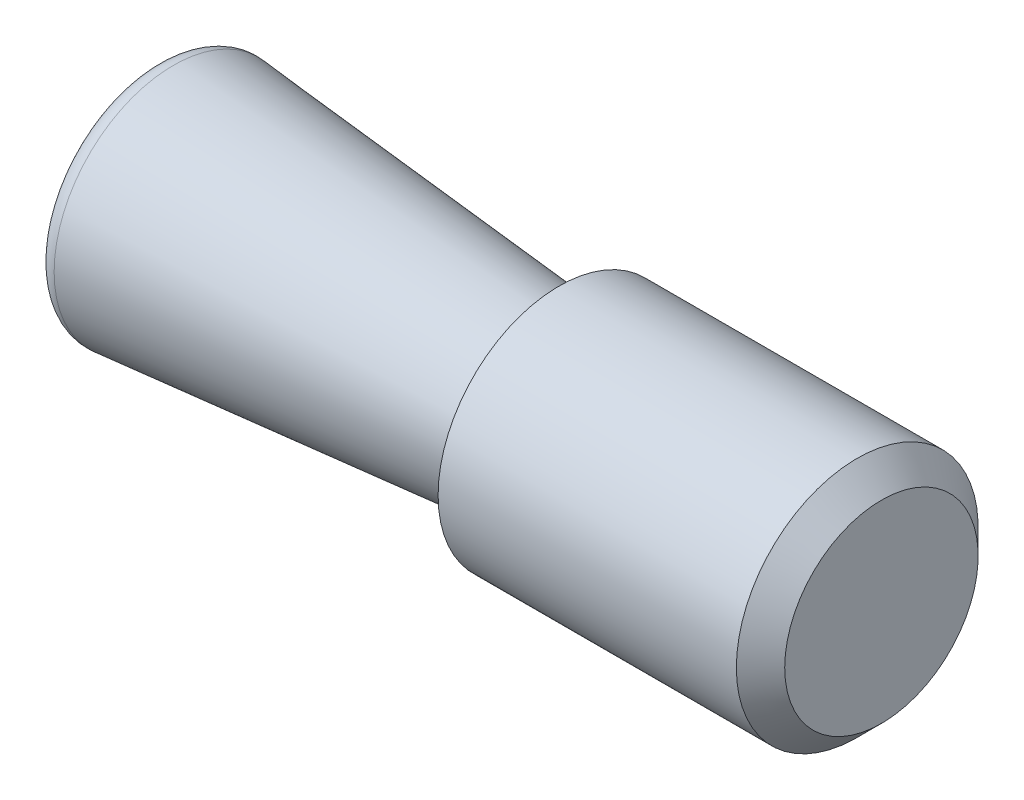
ISO-10303-21;
HEADER;
FILE_DESCRIPTION(('STEP AP214'),'2;1');
FILE_NAME('part.step','',(''),(''),'','','');
FILE_SCHEMA(('AUTOMOTIVE_DESIGN { 1 0 10303 214 1 1 1 1 }'));
ENDSEC;
DATA;
#1=APPLICATION_CONTEXT('core data for automotive mechanical design processes');
#2=APPLICATION_PROTOCOL_DEFINITION('international standard','automotive_design',2000,#1);
#3=PRODUCT_CONTEXT('',#1,'mechanical');
#4=PRODUCT('Part','Part','',(#3));
#5=PRODUCT_RELATED_PRODUCT_CATEGORY('part','',(#4));
#6=PRODUCT_DEFINITION_FORMATION('','',#4);
#7=PRODUCT_DEFINITION_CONTEXT('part definition',#1,'design');
#8=PRODUCT_DEFINITION('design','',#6,#7);
#9=PRODUCT_DEFINITION_SHAPE('','',#8);
#10=(LENGTH_UNIT() NAMED_UNIT(*) SI_UNIT(.MILLI.,.METRE.));
#11=(NAMED_UNIT(*) PLANE_ANGLE_UNIT() SI_UNIT($,.RADIAN.));
#12=(NAMED_UNIT(*) SI_UNIT($,.STERADIAN.) SOLID_ANGLE_UNIT());
#13=UNCERTAINTY_MEASURE_WITH_UNIT(LENGTH_MEASURE(1.E-05),#10,'distance_accuracy_value','');
#14=(GEOMETRIC_REPRESENTATION_CONTEXT(3) GLOBAL_UNCERTAINTY_ASSIGNED_CONTEXT((#13)) GLOBAL_UNIT_ASSIGNED_CONTEXT((#10,
#11,#12)) REPRESENTATION_CONTEXT('',''));
#15=CARTESIAN_POINT('',(0.,0.,0.));
#16=DIRECTION('',(0.,0.,1.));
#17=DIRECTION('',(1.,0.,0.));
#18=AXIS2_PLACEMENT_3D('',#15,#16,#17);
#19=CARTESIAN_POINT('',(0.,1.5,0.));
#20=DIRECTION('',(1.,0.,0.));
#21=DIRECTION('',(0.,0.,-1.));
#22=AXIS2_PLACEMENT_3D('',#19,#20,#21);
#23=PLANE('',#22);
#24=CARTESIAN_POINT('',(0.,0.,0.));
#25=DIRECTION('',(1.,0.,0.));
#26=DIRECTION('',(0.,0.,-1.));
#27=AXIS2_PLACEMENT_3D('',#24,#25,#26);
#28=CIRCLE('',#27,1.28173829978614);
#29=CARTESIAN_POINT('',(0.,0.,-1.28173829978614));
#30=VERTEX_POINT('',#29);
#31=EDGE_CURVE('E44',#30,#30,#28,.F.);
#32=ORIENTED_EDGE('',*,*,#31,.T.);
#33=EDGE_LOOP('',(#32));
#34=FACE_BOUND('',#33,.T.);
#35=ADVANCED_FACE('F30',(#34),#23,.F.);
#36=CARTESIAN_POINT('',(9.,0.,0.));
#37=DIRECTION('',(-1.,0.,0.));
#38=DIRECTION('',(0.,0.,1.));
#39=AXIS2_PLACEMENT_3D('',#36,#37,#38);
#40=PLANE('',#39);
#41=CARTESIAN_POINT('',(9.,0.,0.));
#42=DIRECTION('',(-1.,0.,0.));
#43=DIRECTION('',(0.,0.,1.));
#44=AXIS2_PLACEMENT_3D('',#41,#42,#43);
#45=CIRCLE('',#44,1.2);
#46=CARTESIAN_POINT('',(9.,0.,1.2));
#47=VERTEX_POINT('',#46);
#48=EDGE_CURVE('E10',#47,#47,#45,.F.);
#49=ORIENTED_EDGE('',*,*,#48,.T.);
#50=EDGE_LOOP('',(#49));
#51=FACE_BOUND('',#50,.T.);
#52=ADVANCED_FACE('F66',(#51),#40,.F.);
#53=CARTESIAN_POINT('',(0.,0.,0.));
#54=DIRECTION('',(-1.,0.,0.));
#55=DIRECTION('',(0.,0.,1.));
#56=AXIS2_PLACEMENT_3D('',#53,#54,#55);
#57=CYLINDRICAL_SURFACE('',#56,1.5);
#58=CARTESIAN_POINT('',(8.7,0.,0.));
#59=DIRECTION('',(-1.,0.,0.));
#60=DIRECTION('',(0.,0.,1.));
#61=AXIS2_PLACEMENT_3D('',#58,#59,#60);
#62=CIRCLE('',#61,1.5);
#63=CARTESIAN_POINT('',(8.7,0.,1.5));
#64=VERTEX_POINT('',#63);
#65=EDGE_CURVE('E36',#64,#64,#62,.T.);
#66=ORIENTED_EDGE('',*,*,#65,.T.);
#67=EDGE_LOOP('',(#66));
#68=FACE_BOUND('',#67,.T.);
#69=CARTESIAN_POINT('',(5.,0.,0.));
#70=DIRECTION('',(-1.,0.,0.));
#71=DIRECTION('',(0.,0.,1.));
#72=AXIS2_PLACEMENT_3D('',#69,#70,#71);
#73=CIRCLE('',#72,1.5);
#74=CARTESIAN_POINT('',(5.,0.,1.5));
#75=VERTEX_POINT('',#74);
#76=EDGE_CURVE('E49',#75,#75,#73,.T.);
#77=ORIENTED_EDGE('',*,*,#76,.F.);
#78=EDGE_LOOP('',(#77));
#79=FACE_BOUND('',#78,.T.);
#80=ADVANCED_FACE('F61',(#68,#79),#57,.T.);
#81=CARTESIAN_POINT('',(5.,1.5,0.));
#82=DIRECTION('',(1.,0.,0.));
#83=DIRECTION('',(0.,0.,-1.));
#84=AXIS2_PLACEMENT_3D('',#81,#82,#83);
#85=PLANE('',#84);
#86=CARTESIAN_POINT('',(5.,0.,0.));
#87=DIRECTION('',(-1.,0.,0.));
#88=DIRECTION('',(0.,0.,1.));
#89=AXIS2_PLACEMENT_3D('',#86,#87,#88);
#90=CIRCLE('',#89,1.06255668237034);
#91=CARTESIAN_POINT('',(5.,0.,1.06255668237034));
#92=VERTEX_POINT('',#91);
#93=EDGE_CURVE('E52',#92,#92,#90,.T.);
#94=ORIENTED_EDGE('',*,*,#93,.F.);
#95=EDGE_LOOP('',(#94));
#96=FACE_BOUND('',#95,.T.);
#97=ORIENTED_EDGE('',*,*,#76,.T.);
#98=EDGE_LOOP('',(#97));
#99=FACE_BOUND('',#98,.T.);
#100=ADVANCED_FACE('F58',(#96,#99),#85,.F.);
#101=CARTESIAN_POINT('',(5.,0.,0.));
#102=DIRECTION('',(-1.,0.,0.));
#103=DIRECTION('',(0.,0.,1.));
#104=AXIS2_PLACEMENT_3D('',#101,#102,#103);
#105=CONICAL_SURFACE('',#104,1.06255668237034,0.0872664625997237);
#106=CARTESIAN_POINT('',(0.217431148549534,0.,0.));
#107=DIRECTION('',(1.,0.,0.));
#108=DIRECTION('',(0.,0.,-1.));
#109=AXIS2_PLACEMENT_3D('',#106,#107,#108);
#110=CIRCLE('',#109,1.48097723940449);
#111=CARTESIAN_POINT('',(0.217431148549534,0.,-1.48097723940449));
#112=VERTEX_POINT('',#111);
#113=EDGE_CURVE('E40',#112,#112,#110,.T.);
#114=ORIENTED_EDGE('',*,*,#113,.T.);
#115=EDGE_LOOP('',(#114));
#116=FACE_BOUND('',#115,.T.);
#117=ORIENTED_EDGE('',*,*,#93,.T.);
#118=EDGE_LOOP('',(#117));
#119=FACE_BOUND('',#118,.T.);
#120=ADVANCED_FACE('F56',(#116,#119),#105,.T.);
#121=CARTESIAN_POINT('',(0.2,0.,0.));
#122=DIRECTION('',(1.,0.,0.));
#123=DIRECTION('',(0.,0.,-1.));
#124=AXIS2_PLACEMENT_3D('',#121,#122,#123);
#125=TOROIDAL_SURFACE('',#124,1.28173829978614,0.2);
#126=ORIENTED_EDGE('',*,*,#113,.F.);
#127=EDGE_LOOP('',(#126));
#128=FACE_BOUND('',#127,.T.);
#129=ORIENTED_EDGE('',*,*,#31,.F.);
#130=EDGE_LOOP('',(#129));
#131=FACE_BOUND('',#130,.T.);
#132=ADVANCED_FACE('F77',(#128,#131),#125,.T.);
#133=CARTESIAN_POINT('',(8.7,0.,0.));
#134=DIRECTION('',(-1.,0.,0.));
#135=DIRECTION('',(0.,0.,1.));
#136=AXIS2_PLACEMENT_3D('',#133,#134,#135);
#137=CONICAL_SURFACE('',#136,1.5,0.785398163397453);
#138=ORIENTED_EDGE('',*,*,#48,.F.);
#139=EDGE_LOOP('',(#138));
#140=FACE_BOUND('',#139,.T.);
#141=ORIENTED_EDGE('',*,*,#65,.F.);
#142=EDGE_LOOP('',(#141));
#143=FACE_BOUND('',#142,.T.);
#144=ADVANCED_FACE('F79',(#140,#143),#137,.T.);
#145=CLOSED_SHELL('',(#35,#52,#80,#100,#120,#132,#144));
#146=MANIFOLD_SOLID_BREP('B2',#145);
#147=ADVANCED_BREP_SHAPE_REPRESENTATION('',(#18,#146),#14);
#148=SHAPE_DEFINITION_REPRESENTATION(#9,#147);
ENDSEC;
END-ISO-10303-21;
